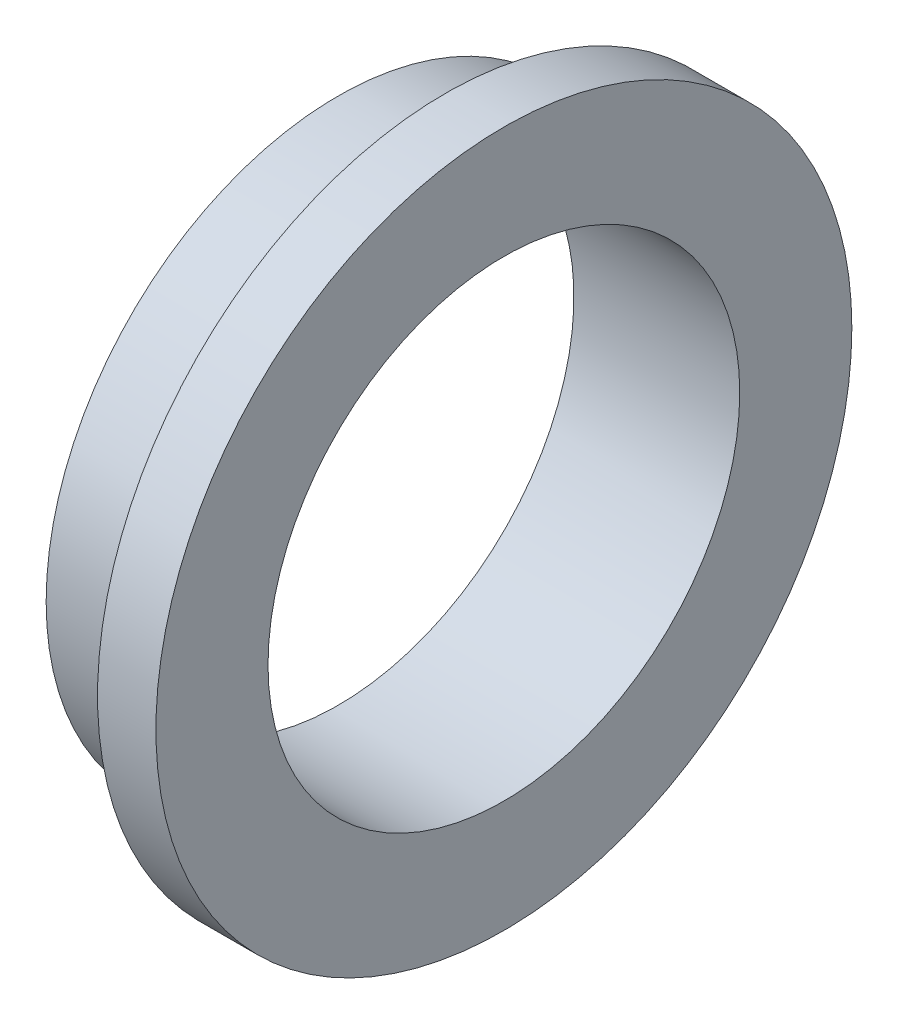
ISO-10303-21;
HEADER;
FILE_DESCRIPTION(('STEP AP214'),'2;1');
FILE_NAME('part.step','',(''),(''),'','','');
FILE_SCHEMA(('AUTOMOTIVE_DESIGN { 1 0 10303 214 1 1 1 1 }'));
ENDSEC;
DATA;
#1=APPLICATION_CONTEXT('core data for automotive mechanical design processes');
#2=APPLICATION_PROTOCOL_DEFINITION('international standard','automotive_design',2000,#1);
#3=PRODUCT_CONTEXT('',#1,'mechanical');
#4=PRODUCT('Part','Part','',(#3));
#5=PRODUCT_RELATED_PRODUCT_CATEGORY('part','',(#4));
#6=PRODUCT_DEFINITION_FORMATION('','',#4);
#7=PRODUCT_DEFINITION_CONTEXT('part definition',#1,'design');
#8=PRODUCT_DEFINITION('design','',#6,#7);
#9=PRODUCT_DEFINITION_SHAPE('','',#8);
#10=(LENGTH_UNIT() NAMED_UNIT(*) SI_UNIT(.MILLI.,.METRE.));
#11=(NAMED_UNIT(*) PLANE_ANGLE_UNIT() SI_UNIT($,.RADIAN.));
#12=(NAMED_UNIT(*) SI_UNIT($,.STERADIAN.) SOLID_ANGLE_UNIT());
#13=UNCERTAINTY_MEASURE_WITH_UNIT(LENGTH_MEASURE(1.E-05),#10,'distance_accuracy_value','');
#14=(GEOMETRIC_REPRESENTATION_CONTEXT(3) GLOBAL_UNCERTAINTY_ASSIGNED_CONTEXT((#13)) GLOBAL_UNIT_ASSIGNED_CONTEXT((#10,
#11,#12)) REPRESENTATION_CONTEXT('',''));
#15=CARTESIAN_POINT('',(0.,0.,0.));
#16=DIRECTION('',(0.,0.,1.));
#17=DIRECTION('',(1.,0.,0.));
#18=AXIS2_PLACEMENT_3D('',#15,#16,#17);
#19=CARTESIAN_POINT('',(0.,0.,0.));
#20=DIRECTION('',(1.,0.,0.));
#21=DIRECTION('',(0.,0.,-1.));
#22=AXIS2_PLACEMENT_3D('',#19,#20,#21);
#23=PLANE('',#22);
#24=CARTESIAN_POINT('',(0.,0.,0.));
#25=DIRECTION('',(1.,0.,0.));
#26=DIRECTION('',(0.,0.,-1.));
#27=AXIS2_PLACEMENT_3D('',#24,#25,#26);
#28=CIRCLE('',#27,18.923);
#29=CARTESIAN_POINT('',(0.,0.,-18.923));
#30=VERTEX_POINT('',#29);
#31=EDGE_CURVE('E47',#30,#30,#28,.T.);
#32=ORIENTED_EDGE('',*,*,#31,.F.);
#33=EDGE_LOOP('',(#32));
#34=FACE_BOUND('',#33,.T.);
#35=CARTESIAN_POINT('',(0.,0.,0.));
#36=DIRECTION('',(1.,0.,0.));
#37=DIRECTION('',(0.,0.,-1.));
#38=AXIS2_PLACEMENT_3D('',#35,#36,#37);
#39=CIRCLE('',#38,15.875);
#40=CARTESIAN_POINT('',(0.,0.,-15.875));
#41=VERTEX_POINT('',#40);
#42=EDGE_CURVE('E10',#41,#41,#39,.F.);
#43=ORIENTED_EDGE('',*,*,#42,.F.);
#44=EDGE_LOOP('',(#43));
#45=FACE_BOUND('',#44,.T.);
#46=ADVANCED_FACE('F36',(#34,#45),#23,.F.);
#47=CARTESIAN_POINT('',(3.175,0.,0.));
#48=DIRECTION('',(1.,0.,0.));
#49=DIRECTION('',(0.,0.,-1.));
#50=AXIS2_PLACEMENT_3D('',#47,#48,#49);
#51=PLANE('',#50);
#52=CARTESIAN_POINT('',(3.175,0.,0.));
#53=DIRECTION('',(1.,0.,0.));
#54=DIRECTION('',(0.,0.,-1.));
#55=AXIS2_PLACEMENT_3D('',#52,#53,#54);
#56=CIRCLE('',#55,18.923);
#57=CARTESIAN_POINT('',(3.175,0.,-18.923));
#58=VERTEX_POINT('',#57);
#59=EDGE_CURVE('E43',#58,#58,#56,.T.);
#60=ORIENTED_EDGE('',*,*,#59,.T.);
#61=EDGE_LOOP('',(#60));
#62=FACE_BOUND('',#61,.T.);
#63=CARTESIAN_POINT('',(3.175,0.,0.));
#64=DIRECTION('',(1.,0.,0.));
#65=DIRECTION('',(0.,0.,-1.));
#66=AXIS2_PLACEMENT_3D('',#63,#64,#65);
#67=CIRCLE('',#66,12.827);
#68=CARTESIAN_POINT('',(3.175,0.,-12.827));
#69=VERTEX_POINT('',#68);
#70=EDGE_CURVE('E52',#69,#69,#67,.T.);
#71=ORIENTED_EDGE('',*,*,#70,.F.);
#72=EDGE_LOOP('',(#71));
#73=FACE_BOUND('',#72,.T.);
#74=ADVANCED_FACE('F79',(#62,#73),#51,.T.);
#75=CARTESIAN_POINT('',(3.175,0.,0.));
#76=DIRECTION('',(-1.,0.,0.));
#77=DIRECTION('',(0.,0.,1.));
#78=AXIS2_PLACEMENT_3D('',#75,#76,#77);
#79=CYLINDRICAL_SURFACE('',#78,18.923);
#80=ORIENTED_EDGE('',*,*,#59,.F.);
#81=EDGE_LOOP('',(#80));
#82=FACE_BOUND('',#81,.T.);
#83=ORIENTED_EDGE('',*,*,#31,.T.);
#84=EDGE_LOOP('',(#83));
#85=FACE_BOUND('',#84,.T.);
#86=ADVANCED_FACE('F38',(#82,#85),#79,.T.);
#87=CARTESIAN_POINT('',(3.175,0.,0.));
#88=DIRECTION('',(-1.,0.,0.));
#89=DIRECTION('',(0.,0.,1.));
#90=AXIS2_PLACEMENT_3D('',#87,#88,#89);
#91=CYLINDRICAL_SURFACE('',#90,12.827);
#92=ORIENTED_EDGE('',*,*,#70,.T.);
#93=EDGE_LOOP('',(#92));
#94=FACE_BOUND('',#93,.T.);
#95=CARTESIAN_POINT('',(-5.842,0.,0.));
#96=DIRECTION('',(-1.,0.,0.));
#97=DIRECTION('',(0.,0.,1.));
#98=AXIS2_PLACEMENT_3D('',#95,#96,#97);
#99=CIRCLE('',#98,12.827);
#100=CARTESIAN_POINT('',(-5.842,0.,12.827));
#101=VERTEX_POINT('',#100);
#102=EDGE_CURVE('E59',#101,#101,#99,.T.);
#103=ORIENTED_EDGE('',*,*,#102,.T.);
#104=EDGE_LOOP('',(#103));
#105=FACE_BOUND('',#104,.T.);
#106=ADVANCED_FACE('F63',(#94,#105),#91,.F.);
#107=CARTESIAN_POINT('',(-5.842,0.,0.));
#108=DIRECTION('',(-1.,0.,0.));
#109=DIRECTION('',(0.,0.,1.));
#110=AXIS2_PLACEMENT_3D('',#107,#108,#109);
#111=PLANE('',#110);
#112=CARTESIAN_POINT('',(-5.842,0.,0.));
#113=DIRECTION('',(-1.,0.,0.));
#114=DIRECTION('',(0.,0.,1.));
#115=AXIS2_PLACEMENT_3D('',#112,#113,#114);
#116=CIRCLE('',#115,15.875);
#117=CARTESIAN_POINT('',(-5.842,0.,15.875));
#118=VERTEX_POINT('',#117);
#119=EDGE_CURVE('E56',#118,#118,#116,.T.);
#120=ORIENTED_EDGE('',*,*,#119,.T.);
#121=EDGE_LOOP('',(#120));
#122=FACE_BOUND('',#121,.T.);
#123=ORIENTED_EDGE('',*,*,#102,.F.);
#124=EDGE_LOOP('',(#123));
#125=FACE_BOUND('',#124,.T.);
#126=ADVANCED_FACE('F65',(#122,#125),#111,.T.);
#127=CARTESIAN_POINT('',(-5.842,0.,0.));
#128=DIRECTION('',(1.,0.,0.));
#129=DIRECTION('',(0.,0.,-1.));
#130=AXIS2_PLACEMENT_3D('',#127,#128,#129);
#131=CYLINDRICAL_SURFACE('',#130,15.875);
#132=ORIENTED_EDGE('',*,*,#119,.F.);
#133=EDGE_LOOP('',(#132));
#134=FACE_BOUND('',#133,.T.);
#135=ORIENTED_EDGE('',*,*,#42,.T.);
#136=EDGE_LOOP('',(#135));
#137=FACE_BOUND('',#136,.T.);
#138=ADVANCED_FACE('F67',(#134,#137),#131,.T.);
#139=CLOSED_SHELL('',(#46,#74,#86,#106,#126,#138));
#140=MANIFOLD_SOLID_BREP('B2',#139);
#141=ADVANCED_BREP_SHAPE_REPRESENTATION('',(#18,#140),#14);
#142=SHAPE_DEFINITION_REPRESENTATION(#9,#141);
ENDSEC;
END-ISO-10303-21;
